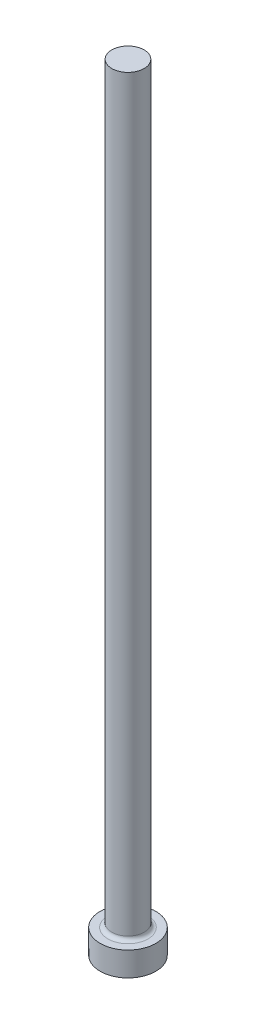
from build123d import *


with BuildPart() as part:
    # Sketch1 → Revolve1 (revolve)
    with BuildSketch(Plane.XY, mode=Mode.PRIVATE) as revolve1_sk:
        with BuildLine():
            Line((0, 0), (5.461, 0))
            Line((5.461, 0), (5.461, 4.7498))
            Line((5.461, 4.7498), (3.937, 4.7498))
            ThreePointArc((3.937, 4.7498), (3.398184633, 4.972984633), (3.175, 5.5118))
            Line((3.175, 5.5118), (3.175, 152.4))
            Line((3.175, 152.4), (0, 152.4))
            Line((0, 152.4), (0, 0))
        make_face()
    revolve(revolve1_sk.sketch.rotate(Axis((0, 152.4, 0), (0, -1, 0)), 180), axis=Axis((0, 152.4, 0), (0, -1, 0)))


solid = part.part
